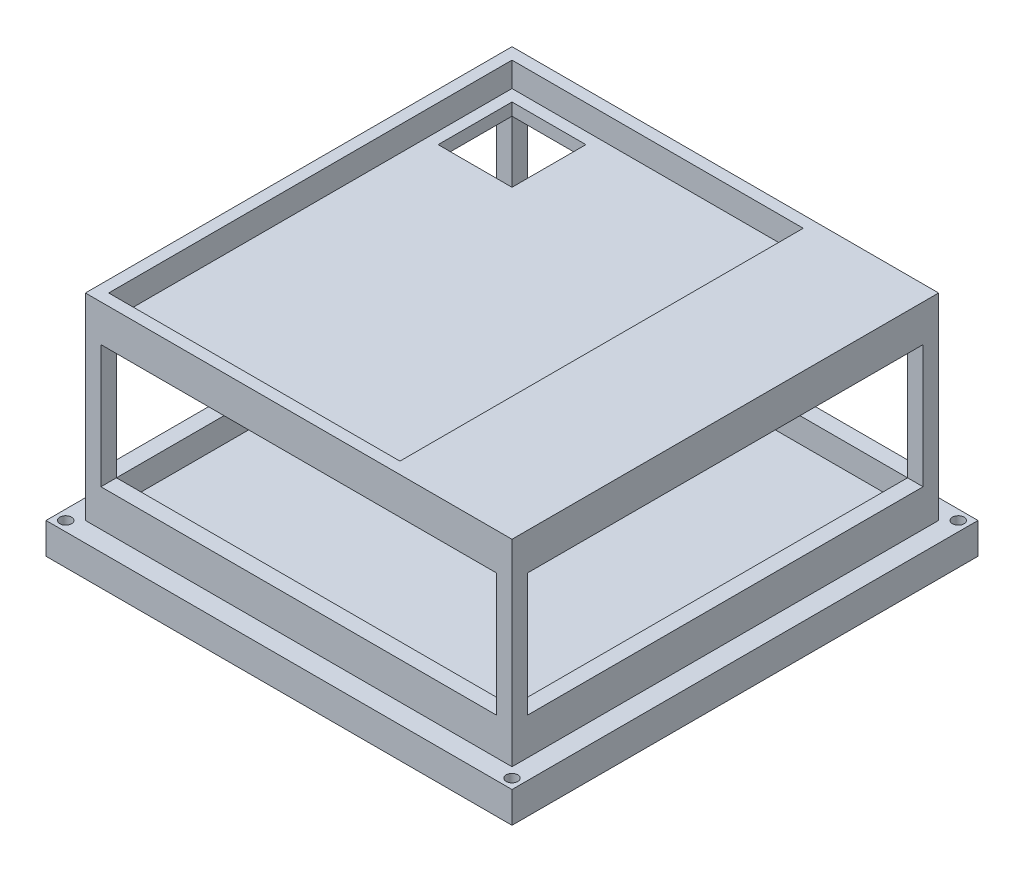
from build123d import *

# Parameters (mm, degrees)
SKETCH1_W           = 110
SKETCH1_H           = 110
BOSS_EXTRUDE1_DEPTH = 9.525
SKETCH3_W           = 120.16
SKETCH3_H           = 120.16
BOSS_EXTRUDE2_DEPTH = 8
SKETCH4_R           = 1.5
CUT_EXTRUDE2_DEPTH  = 86.498177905
SKETCH2_W           = 102
SKETCH2_H           = 102
CUT_EXTRUDE1_DEPTH  = 6.35
SKETCH5_W           = 4
SKETCH5_H           = 4
BOSS_EXTRUDE3_DEPTH = 31.75
SKETCH6_W           = 110
SKETCH6_H           = 110
BOSS_EXTRUDE4_DEPTH = 9.525
SKETCH7_W           = 75.1
SKETCH7_H           = 104
CUT_EXTRUDE3_DEPTH  = 6.35
CUT_EXTRUDE4_REACH  = 101.851
SKETCH8_W           = 19.05
SKETCH8_H           = 19.05


with BuildPart() as part:
    # Sketch1 → Boss-Extrude1 (new body)
    with BuildSketch(Plane(origin=(0, 0, 0), x_dir=(1, 0, 0), z_dir=(0, 1, 0))):
        Rectangle(SKETCH1_W, SKETCH1_H)
    extrude(amount=BOSS_EXTRUDE1_DEPTH)

    # Sketch3 → Boss-Extrude2 (add)
    with BuildSketch(Plane.XZ):
        Rectangle(SKETCH3_W, SKETCH3_H)
    extrude(amount=BOSS_EXTRUDE2_DEPTH)

    # Sketch4 → Cut-Extrude2 (cut, through all)
    with BuildSketch(Plane(origin=(0, 0, 0), x_dir=(1, 0, 0), z_dir=(0, 1, 0))):
        with Locations(Location((-57.54, 57.54, 0), (0, 0, 270))):
            Circle(SKETCH4_R)
        with Locations(Location((57.54, 57.54, 0), (0, 0, 90))):
            Circle(SKETCH4_R)
        with Locations(Location((57.54, -57.54, 0), (0, 0, 270))):
            Circle(SKETCH4_R)
        with Locations(Location((-57.54, -57.54, 0), (0, 0, 90))):
            Circle(SKETCH4_R)
    extrude(amount=-CUT_EXTRUDE2_DEPTH, mode=Mode.SUBTRACT)

    # Sketch2 → Cut-Extrude1 (cut)
    with BuildSketch(Plane(origin=(0, 9.525, 0), x_dir=(1, 0, 0), z_dir=(0, 1, 0))):
        Rectangle(SKETCH2_W, SKETCH2_H)
    extrude(amount=-CUT_EXTRUDE1_DEPTH, mode=Mode.SUBTRACT)

    # Sketch5 → Boss-Extrude3 (add)
    with BuildSketch(Plane(origin=(0, 9.525, 0), x_dir=(1, 0, 0), z_dir=(0, 1, 0))):
        with Locations((-53, 53)):
            Rectangle(SKETCH5_W, SKETCH5_H)
        with Locations((-53, -53)):
            Rectangle(SKETCH5_W, SKETCH5_H)
        with Locations((53, -53)):
            Rectangle(SKETCH5_W, SKETCH5_H)
        with Locations((53, 53)):
            Rectangle(SKETCH5_W, SKETCH5_H)
    extrude(amount=BOSS_EXTRUDE3_DEPTH)

    # Sketch6 → Boss-Extrude4 (add)
    with BuildSketch(Plane(origin=(0, 41.275, 0), x_dir=(1, 0, 0), z_dir=(0, 1, 0))):
        Rectangle(SKETCH6_W, SKETCH6_H)
    extrude(amount=BOSS_EXTRUDE4_DEPTH)

    # Sketch7 → Cut-Extrude3 (cut)
    with BuildSketch(Plane(origin=(0, 50.8, 0), x_dir=(1, 0, 0), z_dir=(0, 1, 0))):
        with Locations((-14.45, 0)):
            Rectangle(SKETCH7_W, SKETCH7_H)
    extrude(amount=-CUT_EXTRUDE3_DEPTH, mode=Mode.SUBTRACT)

    # Sketch8 → Cut-Extrude4 (cut, up to next)
    with BuildSketch(Plane(origin=(0, 44.45, 0), x_dir=(1, 0, 0), z_dir=(0, 1, 0)), mode=Mode.PRIVATE) as cut_extrude4_sk1:
        with Locations((-39.475, 39.475)):
            Rectangle(SKETCH8_W, SKETCH8_H)
    cut_extrude4_tool1 = extrude(cut_extrude4_sk1.sketch, amount=-CUT_EXTRUDE4_REACH, mode=Mode.PRIVATE) & part.part
    add(cut_extrude4_tool1.solids().sort_by_distance((-39.475, 44.45, -39.475))[0], mode=Mode.SUBTRACT)


solid = part.part
